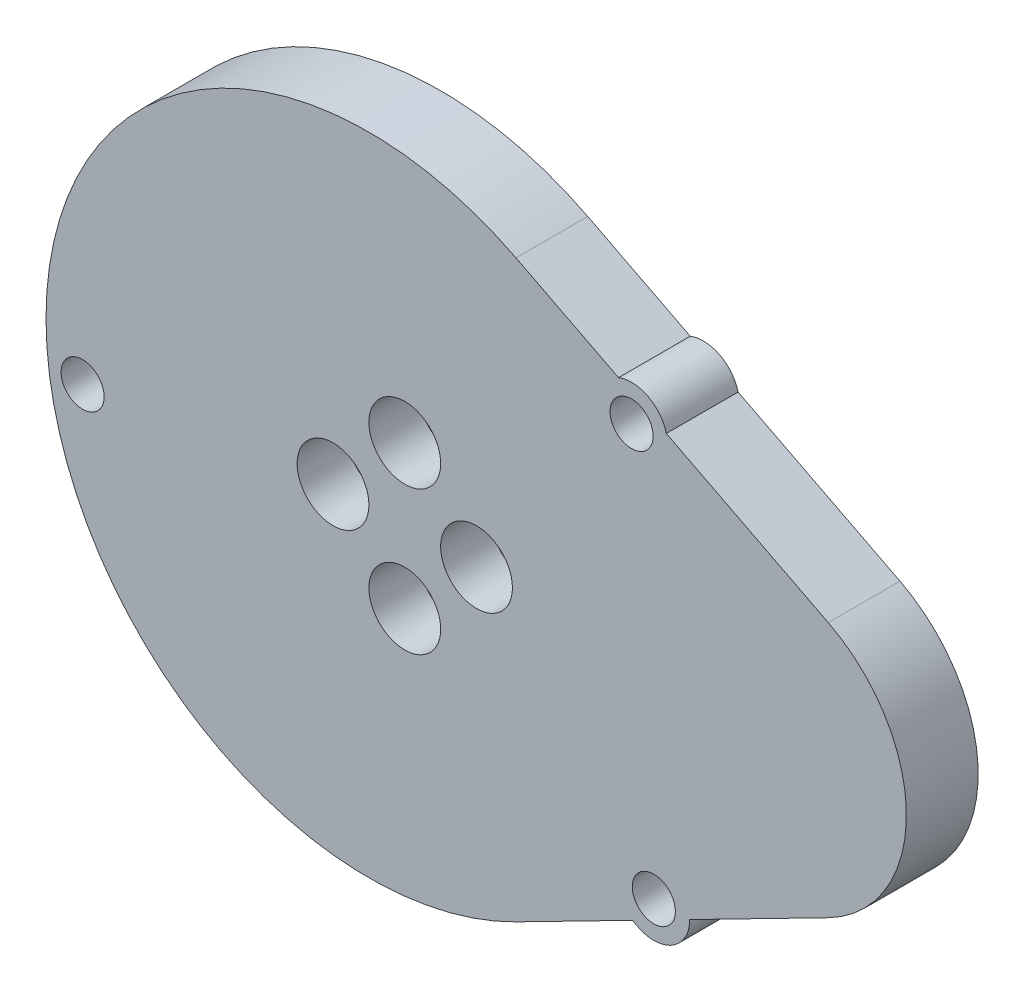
from build123d import *

# Parameters (mm, degrees)
SKETCH1_R           = 1.5
BOSS_EXTRUDE1_DEPTH = 10
SKETCH5_R           = 3
CUT_EXTRUDE4_DEPTH  = 6
CUT_EXTRUDE5_START  = -8
SKETCH5_2_R         = 3
CUT_EXTRUDE5_DEPTH  = 2
SKETCH6_R           = 5
CUT_EXTRUDE6_DEPTH  = 7
SKETCH7_R           = 2.75
CUT_EXTRUDE7_DEPTH  = 6


with BuildPart() as part:
    # Sketch1 → Boss-Extrude1 (new body)
    with BuildSketch(Plane.XY):
        with BuildLine():
            Line((15.496246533, 40.063524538), (29.782629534, 32.756285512))
            ThreePointArc((29.782629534, 32.756285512), (33.881310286, 32.551502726), (36.446191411, 29.347988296))
            Line((36.446191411, 29.347988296), (59.011911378, 17.806010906))
            ThreePointArc((59.011911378, 17.806010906), (69.904443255, 0), (59.011911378, -17.806010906))
            Line((59.011911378, -17.806010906), (39.704408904, -27.681466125))
            ThreePointArc((39.704408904, -27.681466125), (36.981310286, -32.151502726), (31.763084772, -31.743316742))
            Line((31.763084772, -31.743316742), (15.496246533, -40.063524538))
            ThreePointArc((15.496246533, -40.063524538), (-49.995556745, 0), (15.496246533, 40.063524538))
        make_face()
        with Locations((-44.895556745, -5.4)):
            Circle(SKETCH1_R, mode=Mode.SUBTRACT)
        with Locations((34.704443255, -27.7)):
            Circle(SKETCH1_R, mode=Mode.SUBTRACT)
        with Locations((31.604443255, 28.1)):
            Circle(SKETCH1_R, mode=Mode.SUBTRACT)
    extrude(amount=BOSS_EXTRUDE1_DEPTH)

    # Sketch5 → Cut-Extrude4 (cut)
    with BuildSketch(Plane.XY.offset(10)):
        with Locations((-44.895556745, -5.4)):
            Circle(SKETCH5_R)
        with Locations((31.604443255, 28.1)):
            Circle(SKETCH5_R)
        with Locations((34.704443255, -27.7)):
            Circle(SKETCH5_R)
    extrude(amount=-CUT_EXTRUDE4_DEPTH, mode=Mode.SUBTRACT)

    # Sketch5_2 → Cut-Extrude5 (cut)
    with BuildSketch(Plane.XY.offset(10).offset(CUT_EXTRUDE5_START)):
        with Locations((-44.895556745, -5.4)):
            Circle(SKETCH5_2_R)
        with Locations((31.604443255, 28.1)):
            Circle(SKETCH5_2_R)
        with Locations((34.704443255, -27.7)):
            Circle(SKETCH5_2_R)
    extrude(amount=-CUT_EXTRUDE5_DEPTH, mode=Mode.SUBTRACT)

    # Sketch6 → Cut-Extrude6 (cut)
    with BuildSketch(Plane.XY.offset(10)):
        with Locations((-10, 0)):
            Circle(SKETCH6_R)
        with Locations((10, 0)):
            Circle(SKETCH6_R)
        with Locations((0, 10)):
            Circle(SKETCH6_R)
        with Locations((0, -10)):
            Circle(SKETCH6_R)
    extrude(amount=-CUT_EXTRUDE6_DEPTH, mode=Mode.SUBTRACT)

    # Sketch7 → Cut-Extrude7 (cut)
    with BuildSketch(Plane.XY.offset(3)):
        with Locations((-10, 0)):
            Circle(SKETCH7_R)
        with Locations((0, 10)):
            Circle(SKETCH7_R)
        with Locations((10, 0)):
            Circle(SKETCH7_R)
        with Locations((0, -10)):
            Circle(SKETCH7_R)
    extrude(amount=-CUT_EXTRUDE7_DEPTH, mode=Mode.SUBTRACT)


solid = part.part
